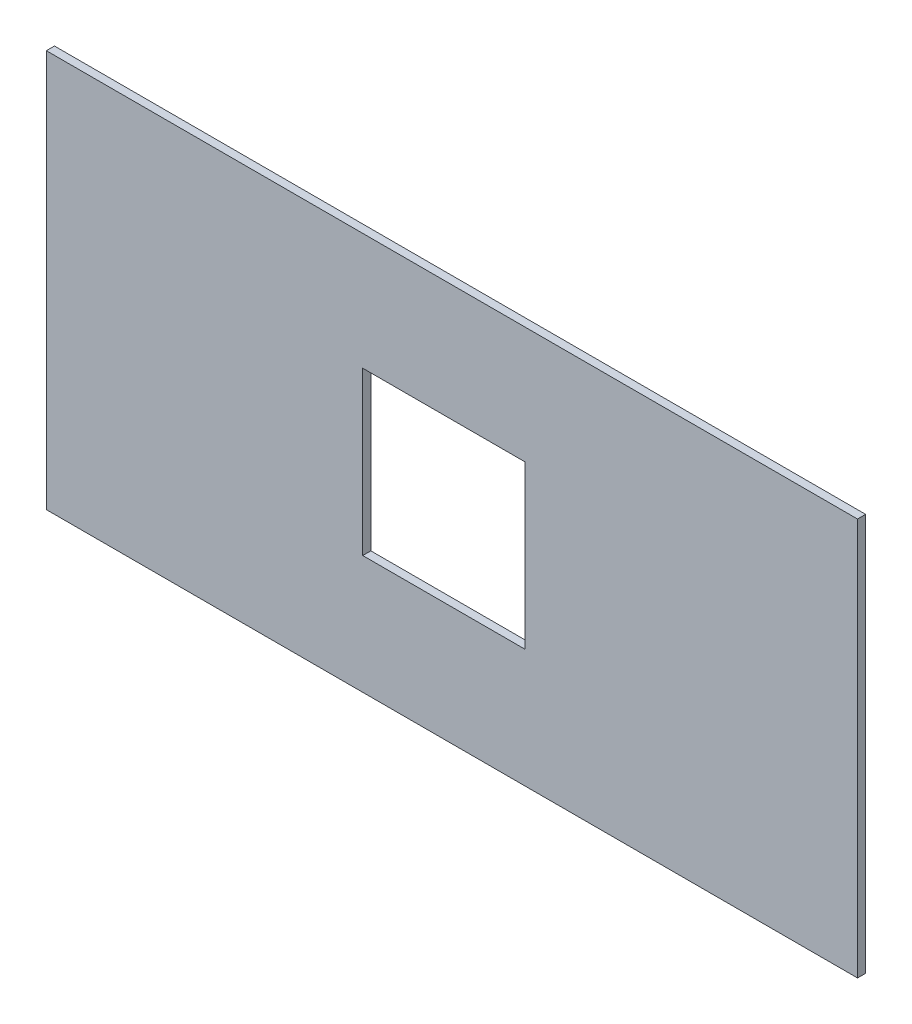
ISO-10303-21;
HEADER;
FILE_DESCRIPTION(('STEP AP214'),'2;1');
FILE_NAME('part.step','',(''),(''),'','','');
FILE_SCHEMA(('AUTOMOTIVE_DESIGN { 1 0 10303 214 1 1 1 1 }'));
ENDSEC;
DATA;
#1=APPLICATION_CONTEXT('core data for automotive mechanical design processes');
#2=APPLICATION_PROTOCOL_DEFINITION('international standard','automotive_design',2000,#1);
#3=PRODUCT_CONTEXT('',#1,'mechanical');
#4=PRODUCT('Part','Part','',(#3));
#5=PRODUCT_RELATED_PRODUCT_CATEGORY('part','',(#4));
#6=PRODUCT_DEFINITION_FORMATION('','',#4);
#7=PRODUCT_DEFINITION_CONTEXT('part definition',#1,'design');
#8=PRODUCT_DEFINITION('design','',#6,#7);
#9=PRODUCT_DEFINITION_SHAPE('','',#8);
#10=(LENGTH_UNIT() NAMED_UNIT(*) SI_UNIT(.MILLI.,.METRE.));
#11=(NAMED_UNIT(*) PLANE_ANGLE_UNIT() SI_UNIT($,.RADIAN.));
#12=(NAMED_UNIT(*) SI_UNIT($,.STERADIAN.) SOLID_ANGLE_UNIT());
#13=UNCERTAINTY_MEASURE_WITH_UNIT(LENGTH_MEASURE(1.E-05),#10,'distance_accuracy_value','');
#14=(GEOMETRIC_REPRESENTATION_CONTEXT(3) GLOBAL_UNCERTAINTY_ASSIGNED_CONTEXT((#13)) GLOBAL_UNIT_ASSIGNED_CONTEXT((#10,
#11,#12)) REPRESENTATION_CONTEXT('',''));
#15=CARTESIAN_POINT('',(0.,0.,0.));
#16=DIRECTION('',(0.,0.,1.));
#17=DIRECTION('',(1.,0.,0.));
#18=AXIS2_PLACEMENT_3D('',#15,#16,#17);
#19=CARTESIAN_POINT('',(594.434767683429,-53.0094440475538,6.35));
#20=DIRECTION('',(0.,0.,1.));
#21=DIRECTION('',(1.,0.,0.));
#22=AXIS2_PLACEMENT_3D('',#19,#20,#21);
#23=PLANE('',#22);
#24=DIRECTION('',(0.,1.,0.));
#25=VECTOR('',#24,1.);
#26=CARTESIAN_POINT('',(594.434767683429,-364.159444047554,6.35));
#27=LINE('',#26,#25);
#28=CARTESIAN_POINT('',(594.434767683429,-364.159444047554,6.35));
#29=VERTEX_POINT('',#28);
#30=CARTESIAN_POINT('',(594.434767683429,-53.0094440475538,6.35));
#31=VERTEX_POINT('',#30);
#32=EDGE_CURVE('E134',#29,#31,#27,.T.);
#33=ORIENTED_EDGE('',*,*,#32,.T.);
#34=DIRECTION('',(-1.,0.,0.));
#35=VECTOR('',#34,1.);
#36=CARTESIAN_POINT('',(594.434767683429,-53.0094440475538,6.35));
#37=LINE('',#36,#35);
#38=CARTESIAN_POINT('',(-40.5652323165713,-53.0094440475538,6.35));
#39=VERTEX_POINT('',#38);
#40=EDGE_CURVE('E137',#31,#39,#37,.T.);
#41=ORIENTED_EDGE('',*,*,#40,.T.);
#42=DIRECTION('',(0.,-1.,0.));
#43=VECTOR('',#42,1.);
#44=CARTESIAN_POINT('',(-40.5652323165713,-364.159444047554,6.35));
#45=LINE('',#44,#43);
#46=CARTESIAN_POINT('',(-40.5652323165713,-364.159444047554,6.35));
#47=VERTEX_POINT('',#46);
#48=EDGE_CURVE('E140',#39,#47,#45,.T.);
#49=ORIENTED_EDGE('',*,*,#48,.T.);
#50=DIRECTION('',(1.,0.,0.));
#51=VECTOR('',#50,1.);
#52=CARTESIAN_POINT('',(594.434767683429,-364.159444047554,6.35));
#53=LINE('',#52,#51);
#54=EDGE_CURVE('E142',#47,#29,#53,.T.);
#55=ORIENTED_EDGE('',*,*,#54,.T.);
#56=EDGE_LOOP('',(#33,#41,#49,#55));
#57=FACE_BOUND('',#56,.T.);
#58=DIRECTION('',(1.,0.,0.));
#59=VECTOR('',#58,1.);
#60=CARTESIAN_POINT('',(207.084767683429,-271.432251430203,6.35));
#61=LINE('',#60,#59);
#62=CARTESIAN_POINT('',(207.084767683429,-271.432251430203,6.35));
#63=VERTEX_POINT('',#62);
#64=CARTESIAN_POINT('',(334.084767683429,-271.432251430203,6.35));
#65=VERTEX_POINT('',#64);
#66=EDGE_CURVE('E106',#63,#65,#61,.T.);
#67=ORIENTED_EDGE('',*,*,#66,.F.);
#68=DIRECTION('',(0.,-1.,0.));
#69=VECTOR('',#68,1.);
#70=CARTESIAN_POINT('',(207.084767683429,-271.432251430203,6.35));
#71=LINE('',#70,#69);
#72=CARTESIAN_POINT('',(207.084767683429,-144.432251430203,6.35));
#73=VERTEX_POINT('',#72);
#74=EDGE_CURVE('E98',#73,#63,#71,.T.);
#75=ORIENTED_EDGE('',*,*,#74,.F.);
#76=DIRECTION('',(-1.,0.,0.));
#77=VECTOR('',#76,1.);
#78=CARTESIAN_POINT('',(207.084767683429,-144.432251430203,6.35));
#79=LINE('',#78,#77);
#80=CARTESIAN_POINT('',(334.084767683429,-144.432251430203,6.35));
#81=VERTEX_POINT('',#80);
#82=EDGE_CURVE('E120',#81,#73,#79,.T.);
#83=ORIENTED_EDGE('',*,*,#82,.F.);
#84=DIRECTION('',(0.,1.,0.));
#85=VECTOR('',#84,1.);
#86=CARTESIAN_POINT('',(334.084767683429,-271.432251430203,6.35));
#87=LINE('',#86,#85);
#88=EDGE_CURVE('E118',#65,#81,#87,.T.);
#89=ORIENTED_EDGE('',*,*,#88,.F.);
#90=EDGE_LOOP('',(#67,#75,#83,#89));
#91=FACE_BOUND('',#90,.T.);
#92=ADVANCED_FACE('F33',(#57,#91),#23,.T.);
#93=CARTESIAN_POINT('',(594.434767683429,-53.0094440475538,0.));
#94=DIRECTION('',(0.,0.,1.));
#95=DIRECTION('',(1.,0.,0.));
#96=AXIS2_PLACEMENT_3D('',#93,#94,#95);
#97=PLANE('',#96);
#98=DIRECTION('',(0.,1.,0.));
#99=VECTOR('',#98,1.);
#100=CARTESIAN_POINT('',(594.434767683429,-364.159444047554,0.));
#101=LINE('',#100,#99);
#102=CARTESIAN_POINT('',(594.434767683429,-364.159444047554,0.));
#103=VERTEX_POINT('',#102);
#104=CARTESIAN_POINT('',(594.434767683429,-53.0094440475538,0.));
#105=VERTEX_POINT('',#104);
#106=EDGE_CURVE('E114',#103,#105,#101,.T.);
#107=ORIENTED_EDGE('',*,*,#106,.F.);
#108=DIRECTION('',(1.,0.,0.));
#109=VECTOR('',#108,1.);
#110=CARTESIAN_POINT('',(594.434767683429,-364.159444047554,0.));
#111=LINE('',#110,#109);
#112=CARTESIAN_POINT('',(-40.5652323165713,-364.159444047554,0.));
#113=VERTEX_POINT('',#112);
#114=EDGE_CURVE('E138',#113,#103,#111,.T.);
#115=ORIENTED_EDGE('',*,*,#114,.F.);
#116=DIRECTION('',(0.,-1.,0.));
#117=VECTOR('',#116,1.);
#118=CARTESIAN_POINT('',(-40.5652323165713,-364.159444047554,0.));
#119=LINE('',#118,#117);
#120=CARTESIAN_POINT('',(-40.5652323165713,-53.0094440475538,0.));
#121=VERTEX_POINT('',#120);
#122=EDGE_CURVE('E149',#121,#113,#119,.T.);
#123=ORIENTED_EDGE('',*,*,#122,.F.);
#124=DIRECTION('',(-1.,0.,0.));
#125=VECTOR('',#124,1.);
#126=CARTESIAN_POINT('',(594.434767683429,-53.0094440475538,0.));
#127=LINE('',#126,#125);
#128=EDGE_CURVE('E147',#105,#121,#127,.T.);
#129=ORIENTED_EDGE('',*,*,#128,.F.);
#130=EDGE_LOOP('',(#107,#115,#123,#129));
#131=FACE_BOUND('',#130,.T.);
#132=DIRECTION('',(0.,-1.,0.));
#133=VECTOR('',#132,1.);
#134=CARTESIAN_POINT('',(207.084767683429,-271.432251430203,0.));
#135=LINE('',#134,#133);
#136=CARTESIAN_POINT('',(207.084767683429,-144.432251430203,0.));
#137=VERTEX_POINT('',#136);
#138=CARTESIAN_POINT('',(207.084767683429,-271.432251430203,0.));
#139=VERTEX_POINT('',#138);
#140=EDGE_CURVE('E56',#137,#139,#135,.T.);
#141=ORIENTED_EDGE('',*,*,#140,.T.);
#142=DIRECTION('',(1.,0.,0.));
#143=VECTOR('',#142,1.);
#144=CARTESIAN_POINT('',(207.084767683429,-271.432251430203,0.));
#145=LINE('',#144,#143);
#146=CARTESIAN_POINT('',(334.084767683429,-271.432251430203,0.));
#147=VERTEX_POINT('',#146);
#148=EDGE_CURVE('E113',#139,#147,#145,.T.);
#149=ORIENTED_EDGE('',*,*,#148,.T.);
#150=DIRECTION('',(0.,1.,0.));
#151=VECTOR('',#150,1.);
#152=CARTESIAN_POINT('',(334.084767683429,-271.432251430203,0.));
#153=LINE('',#152,#151);
#154=CARTESIAN_POINT('',(334.084767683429,-144.432251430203,0.));
#155=VERTEX_POINT('',#154);
#156=EDGE_CURVE('E126',#147,#155,#153,.T.);
#157=ORIENTED_EDGE('',*,*,#156,.T.);
#158=DIRECTION('',(-1.,0.,0.));
#159=VECTOR('',#158,1.);
#160=CARTESIAN_POINT('',(207.084767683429,-144.432251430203,0.));
#161=LINE('',#160,#159);
#162=EDGE_CURVE('E107',#155,#137,#161,.T.);
#163=ORIENTED_EDGE('',*,*,#162,.T.);
#164=EDGE_LOOP('',(#141,#149,#157,#163));
#165=FACE_BOUND('',#164,.T.);
#166=ADVANCED_FACE('F167',(#131,#165),#97,.F.);
#167=CARTESIAN_POINT('',(594.434767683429,-364.159444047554,6.35));
#168=DIRECTION('',(-1.,0.,0.));
#169=DIRECTION('',(0.,-1.,0.));
#170=AXIS2_PLACEMENT_3D('',#167,#168,#169);
#171=PLANE('',#170);
#172=ORIENTED_EDGE('',*,*,#106,.T.);
#173=DIRECTION('',(0.,0.,-1.));
#174=VECTOR('',#173,1.);
#175=CARTESIAN_POINT('',(594.434767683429,-53.0094440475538,6.35));
#176=LINE('',#175,#174);
#177=EDGE_CURVE('E11',#31,#105,#176,.T.);
#178=ORIENTED_EDGE('',*,*,#177,.F.);
#179=ORIENTED_EDGE('',*,*,#32,.F.);
#180=DIRECTION('',(0.,0.,-1.));
#181=VECTOR('',#180,1.);
#182=CARTESIAN_POINT('',(594.434767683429,-364.159444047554,6.35));
#183=LINE('',#182,#181);
#184=EDGE_CURVE('E144',#29,#103,#183,.T.);
#185=ORIENTED_EDGE('',*,*,#184,.T.);
#186=EDGE_LOOP('',(#172,#178,#179,#185));
#187=FACE_BOUND('',#186,.T.);
#188=ADVANCED_FACE('F35',(#187),#171,.F.);
#189=CARTESIAN_POINT('',(594.434767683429,-53.0094440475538,6.35));
#190=DIRECTION('',(0.,-1.,0.));
#191=DIRECTION('',(1.,0.,0.));
#192=AXIS2_PLACEMENT_3D('',#189,#190,#191);
#193=PLANE('',#192);
#194=ORIENTED_EDGE('',*,*,#128,.T.);
#195=DIRECTION('',(0.,0.,-1.));
#196=VECTOR('',#195,1.);
#197=CARTESIAN_POINT('',(-40.5652323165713,-53.0094440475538,6.35));
#198=LINE('',#197,#196);
#199=EDGE_CURVE('E41',#39,#121,#198,.T.);
#200=ORIENTED_EDGE('',*,*,#199,.F.);
#201=ORIENTED_EDGE('',*,*,#40,.F.);
#202=ORIENTED_EDGE('',*,*,#177,.T.);
#203=EDGE_LOOP('',(#194,#200,#201,#202));
#204=FACE_BOUND('',#203,.T.);
#205=ADVANCED_FACE('F177',(#204),#193,.F.);
#206=CARTESIAN_POINT('',(-40.5652323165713,-364.159444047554,6.35));
#207=DIRECTION('',(1.,0.,0.));
#208=DIRECTION('',(0.,0.,-1.));
#209=AXIS2_PLACEMENT_3D('',#206,#207,#208);
#210=PLANE('',#209);
#211=ORIENTED_EDGE('',*,*,#122,.T.);
#212=DIRECTION('',(0.,0.,-1.));
#213=VECTOR('',#212,1.);
#214=CARTESIAN_POINT('',(-40.5652323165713,-364.159444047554,6.35));
#215=LINE('',#214,#213);
#216=EDGE_CURVE('E154',#47,#113,#215,.T.);
#217=ORIENTED_EDGE('',*,*,#216,.F.);
#218=ORIENTED_EDGE('',*,*,#48,.F.);
#219=ORIENTED_EDGE('',*,*,#199,.T.);
#220=EDGE_LOOP('',(#211,#217,#218,#219));
#221=FACE_BOUND('',#220,.T.);
#222=ADVANCED_FACE('F161',(#221),#210,.F.);
#223=CARTESIAN_POINT('',(594.434767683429,-364.159444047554,6.35));
#224=DIRECTION('',(0.,1.,0.));
#225=DIRECTION('',(-1.,0.,0.));
#226=AXIS2_PLACEMENT_3D('',#223,#224,#225);
#227=PLANE('',#226);
#228=ORIENTED_EDGE('',*,*,#114,.T.);
#229=ORIENTED_EDGE('',*,*,#184,.F.);
#230=ORIENTED_EDGE('',*,*,#54,.F.);
#231=ORIENTED_EDGE('',*,*,#216,.T.);
#232=EDGE_LOOP('',(#228,#229,#230,#231));
#233=FACE_BOUND('',#232,.T.);
#234=ADVANCED_FACE('F171',(#233),#227,.F.);
#235=CARTESIAN_POINT('',(207.084767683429,-271.432251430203,6.35));
#236=DIRECTION('',(1.,0.,0.));
#237=DIRECTION('',(0.,0.,-1.));
#238=AXIS2_PLACEMENT_3D('',#235,#236,#237);
#239=PLANE('',#238);
#240=ORIENTED_EDGE('',*,*,#140,.F.);
#241=DIRECTION('',(0.,0.,-1.));
#242=VECTOR('',#241,1.);
#243=CARTESIAN_POINT('',(207.084767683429,-144.432251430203,6.35));
#244=LINE('',#243,#242);
#245=EDGE_CURVE('E102',#73,#137,#244,.T.);
#246=ORIENTED_EDGE('',*,*,#245,.F.);
#247=ORIENTED_EDGE('',*,*,#74,.T.);
#248=DIRECTION('',(0.,0.,-1.));
#249=VECTOR('',#248,1.);
#250=CARTESIAN_POINT('',(207.084767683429,-271.432251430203,6.35));
#251=LINE('',#250,#249);
#252=EDGE_CURVE('E101',#63,#139,#251,.T.);
#253=ORIENTED_EDGE('',*,*,#252,.T.);
#254=EDGE_LOOP('',(#240,#246,#247,#253));
#255=FACE_BOUND('',#254,.T.);
#256=ADVANCED_FACE('F100',(#255),#239,.T.);
#257=CARTESIAN_POINT('',(207.084767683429,-271.432251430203,6.35));
#258=DIRECTION('',(0.,1.,0.));
#259=DIRECTION('',(0.,0.,1.));
#260=AXIS2_PLACEMENT_3D('',#257,#258,#259);
#261=PLANE('',#260);
#262=ORIENTED_EDGE('',*,*,#148,.F.);
#263=ORIENTED_EDGE('',*,*,#252,.F.);
#264=ORIENTED_EDGE('',*,*,#66,.T.);
#265=DIRECTION('',(0.,0.,-1.));
#266=VECTOR('',#265,1.);
#267=CARTESIAN_POINT('',(334.084767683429,-271.432251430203,6.35));
#268=LINE('',#267,#266);
#269=EDGE_CURVE('E115',#65,#147,#268,.T.);
#270=ORIENTED_EDGE('',*,*,#269,.T.);
#271=EDGE_LOOP('',(#262,#263,#264,#270));
#272=FACE_BOUND('',#271,.T.);
#273=ADVANCED_FACE('F110',(#272),#261,.T.);
#274=CARTESIAN_POINT('',(334.084767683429,-271.432251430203,6.35));
#275=DIRECTION('',(-1.,0.,0.));
#276=DIRECTION('',(0.,0.,1.));
#277=AXIS2_PLACEMENT_3D('',#274,#275,#276);
#278=PLANE('',#277);
#279=ORIENTED_EDGE('',*,*,#156,.F.);
#280=ORIENTED_EDGE('',*,*,#269,.F.);
#281=ORIENTED_EDGE('',*,*,#88,.T.);
#282=DIRECTION('',(0.,0.,-1.));
#283=VECTOR('',#282,1.);
#284=CARTESIAN_POINT('',(334.084767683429,-144.432251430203,6.35));
#285=LINE('',#284,#283);
#286=EDGE_CURVE('E48',#81,#155,#285,.T.);
#287=ORIENTED_EDGE('',*,*,#286,.T.);
#288=EDGE_LOOP('',(#279,#280,#281,#287));
#289=FACE_BOUND('',#288,.T.);
#290=ADVANCED_FACE('F200',(#289),#278,.T.);
#291=CARTESIAN_POINT('',(207.084767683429,-144.432251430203,6.35));
#292=DIRECTION('',(0.,-1.,0.));
#293=DIRECTION('',(0.,0.,-1.));
#294=AXIS2_PLACEMENT_3D('',#291,#292,#293);
#295=PLANE('',#294);
#296=ORIENTED_EDGE('',*,*,#162,.F.);
#297=ORIENTED_EDGE('',*,*,#286,.F.);
#298=ORIENTED_EDGE('',*,*,#82,.T.);
#299=ORIENTED_EDGE('',*,*,#245,.T.);
#300=EDGE_LOOP('',(#296,#297,#298,#299));
#301=FACE_BOUND('',#300,.T.);
#302=ADVANCED_FACE('F204',(#301),#295,.T.);
#303=CLOSED_SHELL('',(#92,#166,#188,#205,#222,#234,#256,#273,#290,#302));
#304=MANIFOLD_SOLID_BREP('B2',#303);
#305=ADVANCED_BREP_SHAPE_REPRESENTATION('',(#18,#304),#14);
#306=SHAPE_DEFINITION_REPRESENTATION(#9,#305);
ENDSEC;
END-ISO-10303-21;
